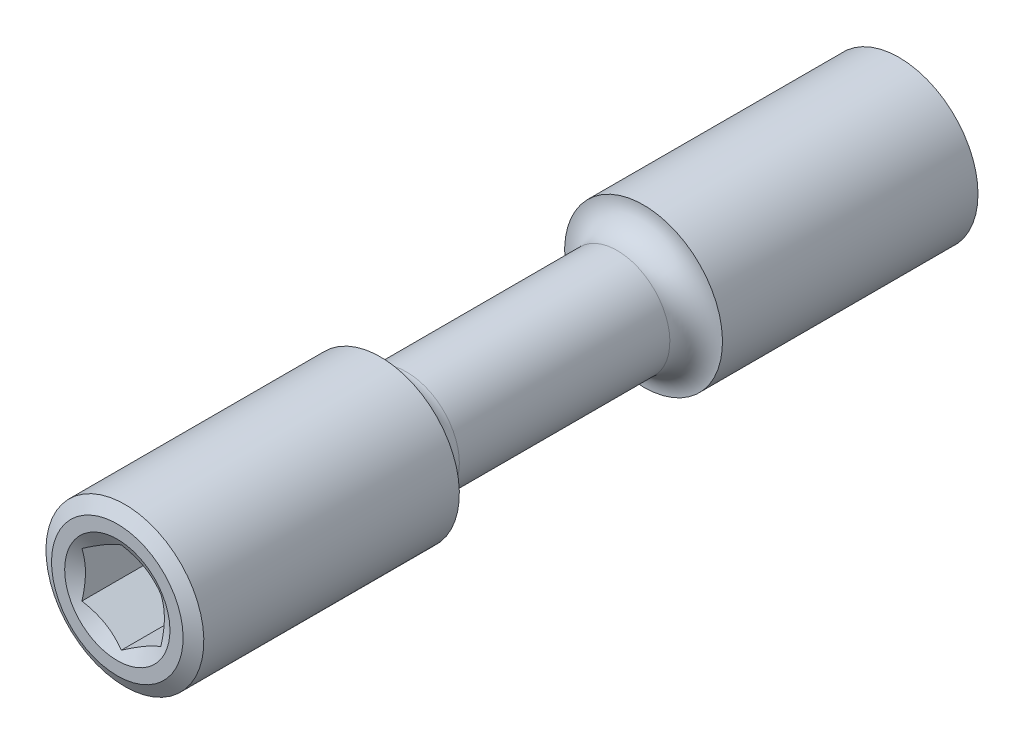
ISO-10303-21;
HEADER;
FILE_DESCRIPTION(('STEP AP214'),'2;1');
FILE_NAME('part.step','',(''),(''),'','','');
FILE_SCHEMA(('AUTOMOTIVE_DESIGN { 1 0 10303 214 1 1 1 1 }'));
ENDSEC;
DATA;
#1=APPLICATION_CONTEXT('core data for automotive mechanical design processes');
#2=APPLICATION_PROTOCOL_DEFINITION('international standard','automotive_design',2000,#1);
#3=PRODUCT_CONTEXT('',#1,'mechanical');
#4=PRODUCT('Part','Part','',(#3));
#5=PRODUCT_RELATED_PRODUCT_CATEGORY('part','',(#4));
#6=PRODUCT_DEFINITION_FORMATION('','',#4);
#7=PRODUCT_DEFINITION_CONTEXT('part definition',#1,'design');
#8=PRODUCT_DEFINITION('design','',#6,#7);
#9=PRODUCT_DEFINITION_SHAPE('','',#8);
#10=(LENGTH_UNIT() NAMED_UNIT(*) SI_UNIT(.MILLI.,.METRE.));
#11=(NAMED_UNIT(*) PLANE_ANGLE_UNIT() SI_UNIT($,.RADIAN.));
#12=(NAMED_UNIT(*) SI_UNIT($,.STERADIAN.) SOLID_ANGLE_UNIT());
#13=UNCERTAINTY_MEASURE_WITH_UNIT(LENGTH_MEASURE(1.E-05),#10,'distance_accuracy_value','');
#14=(GEOMETRIC_REPRESENTATION_CONTEXT(3) GLOBAL_UNCERTAINTY_ASSIGNED_CONTEXT((#13)) GLOBAL_UNIT_ASSIGNED_CONTEXT((#10,
#11,#12)) REPRESENTATION_CONTEXT('',''));
#15=CARTESIAN_POINT('',(0.,0.,0.));
#16=DIRECTION('',(0.,0.,1.));
#17=DIRECTION('',(1.,0.,0.));
#18=AXIS2_PLACEMENT_3D('',#15,#16,#17);
#19=CARTESIAN_POINT('',(0.,0.,15.));
#20=DIRECTION('',(0.,0.,-1.));
#21=DIRECTION('',(0.,-1.,0.));
#22=AXIS2_PLACEMENT_3D('',#19,#20,#21);
#23=PLANE('',#22);
#24=CARTESIAN_POINT('',(0.,0.,15.));
#25=DIRECTION('',(0.,0.,-1.));
#26=DIRECTION('',(0.,-1.,0.));
#27=AXIS2_PLACEMENT_3D('',#24,#25,#26);
#28=CIRCLE('',#27,2.5);
#29=CARTESIAN_POINT('',(0.,-2.50000000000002,15.));
#30=VERTEX_POINT('',#29);
#31=EDGE_CURVE('E255',#30,#30,#28,.F.);
#32=ORIENTED_EDGE('',*,*,#31,.T.);
#33=EDGE_LOOP('',(#32));
#34=FACE_BOUND('',#33,.T.);
#35=CARTESIAN_POINT('',(0.,0.,15.));
#36=DIRECTION('',(0.,0.,-1.));
#37=DIRECTION('',(-1.,0.,0.));
#38=AXIS2_PLACEMENT_3D('',#35,#36,#37);
#39=CIRCLE('',#38,2.);
#40=CARTESIAN_POINT('',(-2.,0.,15.));
#41=VERTEX_POINT('',#40);
#42=EDGE_CURVE('E470',#41,#41,#39,.T.);
#43=ORIENTED_EDGE('',*,*,#42,.T.);
#44=EDGE_LOOP('',(#43));
#45=FACE_BOUND('',#44,.T.);
#46=ADVANCED_FACE('F14',(#34,#45),#23,.F.);
#47=CARTESIAN_POINT('',(0.,0.,15.));
#48=DIRECTION('',(0.,0.,-1.));
#49=DIRECTION('',(0.,-1.,0.));
#50=AXIS2_PLACEMENT_3D('',#47,#48,#49);
#51=CYLINDRICAL_SURFACE('',#50,3.);
#52=CARTESIAN_POINT('',(0.,0.,14.7113248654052));
#53=DIRECTION('',(0.,0.,-1.));
#54=DIRECTION('',(0.,-1.,0.));
#55=AXIS2_PLACEMENT_3D('',#52,#53,#54);
#56=CIRCLE('',#55,3.);
#57=CARTESIAN_POINT('',(0.,-3.00000000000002,14.7113248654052));
#58=VERTEX_POINT('',#57);
#59=EDGE_CURVE('E94',#58,#58,#56,.T.);
#60=ORIENTED_EDGE('',*,*,#59,.T.);
#61=EDGE_LOOP('',(#60));
#62=FACE_BOUND('',#61,.T.);
#63=CARTESIAN_POINT('',(0.,0.,5.));
#64=DIRECTION('',(0.,0.,-1.));
#65=DIRECTION('',(0.,-1.,0.));
#66=AXIS2_PLACEMENT_3D('',#63,#64,#65);
#67=CIRCLE('',#66,3.);
#68=CARTESIAN_POINT('',(0.,-3.00000000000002,5.));
#69=VERTEX_POINT('',#68);
#70=EDGE_CURVE('E127',#69,#69,#67,.T.);
#71=ORIENTED_EDGE('',*,*,#70,.F.);
#72=EDGE_LOOP('',(#71));
#73=FACE_BOUND('',#72,.T.);
#74=ADVANCED_FACE('F211',(#62,#73),#51,.T.);
#75=CARTESIAN_POINT('',(0.,0.,15.));
#76=DIRECTION('',(0.,0.,-1.));
#77=DIRECTION('',(0.,-1.,0.));
#78=AXIS2_PLACEMENT_3D('',#75,#76,#77);
#79=CYLINDRICAL_SURFACE('',#78,2.);
#80=CARTESIAN_POINT('',(0.,0.,4.));
#81=DIRECTION('',(0.,0.,1.));
#82=DIRECTION('',(0.,1.,0.));
#83=AXIS2_PLACEMENT_3D('',#80,#81,#82);
#84=CIRCLE('',#83,2.);
#85=CARTESIAN_POINT('',(0.,1.99999999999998,4.));
#86=VERTEX_POINT('',#85);
#87=EDGE_CURVE('E9',#86,#86,#84,.F.);
#88=ORIENTED_EDGE('',*,*,#87,.T.);
#89=EDGE_LOOP('',(#88));
#90=FACE_BOUND('',#89,.T.);
#91=CARTESIAN_POINT('',(0.,0.,-4.));
#92=DIRECTION('',(0.,0.,-1.));
#93=DIRECTION('',(0.,-1.,0.));
#94=AXIS2_PLACEMENT_3D('',#91,#92,#93);
#95=CIRCLE('',#94,2.);
#96=CARTESIAN_POINT('',(0.,-2.00000000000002,-4.));
#97=VERTEX_POINT('',#96);
#98=EDGE_CURVE('E22',#97,#97,#95,.F.);
#99=ORIENTED_EDGE('',*,*,#98,.T.);
#100=EDGE_LOOP('',(#99));
#101=FACE_BOUND('',#100,.T.);
#102=ADVANCED_FACE('F218',(#90,#101),#79,.T.);
#103=CARTESIAN_POINT('',(0.,0.,15.));
#104=DIRECTION('',(0.,0.,-1.));
#105=DIRECTION('',(0.,-1.,0.));
#106=AXIS2_PLACEMENT_3D('',#103,#104,#105);
#107=CYLINDRICAL_SURFACE('',#106,3.);
#108=CARTESIAN_POINT('',(0.,0.,-14.7113248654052));
#109=DIRECTION('',(0.,0.,1.));
#110=DIRECTION('',(0.,1.,0.));
#111=AXIS2_PLACEMENT_3D('',#108,#109,#110);
#112=CIRCLE('',#111,3.);
#113=CARTESIAN_POINT('',(0.,2.99999999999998,-14.7113248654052));
#114=VERTEX_POINT('',#113);
#115=EDGE_CURVE('E249',#114,#114,#112,.T.);
#116=ORIENTED_EDGE('',*,*,#115,.T.);
#117=EDGE_LOOP('',(#116));
#118=FACE_BOUND('',#117,.T.);
#119=CARTESIAN_POINT('',(0.,0.,-5.));
#120=DIRECTION('',(0.,0.,-1.));
#121=DIRECTION('',(0.,-1.,0.));
#122=AXIS2_PLACEMENT_3D('',#119,#120,#121);
#123=CIRCLE('',#122,3.);
#124=CARTESIAN_POINT('',(0.,-3.00000000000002,-5.));
#125=VERTEX_POINT('',#124);
#126=EDGE_CURVE('E124',#125,#125,#123,.T.);
#127=ORIENTED_EDGE('',*,*,#126,.T.);
#128=EDGE_LOOP('',(#127));
#129=FACE_BOUND('',#128,.T.);
#130=ADVANCED_FACE('F246',(#118,#129),#107,.T.);
#131=CARTESIAN_POINT('',(0.,0.,-15.));
#132=DIRECTION('',(0.,0.,1.));
#133=DIRECTION('',(0.,1.,0.));
#134=AXIS2_PLACEMENT_3D('',#131,#132,#133);
#135=PLANE('',#134);
#136=CARTESIAN_POINT('',(0.,0.,-15.));
#137=DIRECTION('',(0.,0.,1.));
#138=DIRECTION('',(0.,1.,0.));
#139=AXIS2_PLACEMENT_3D('',#136,#137,#138);
#140=CIRCLE('',#139,2.5);
#141=CARTESIAN_POINT('',(0.,2.49999999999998,-15.));
#142=VERTEX_POINT('',#141);
#143=EDGE_CURVE('E251',#142,#142,#140,.F.);
#144=ORIENTED_EDGE('',*,*,#143,.T.);
#145=EDGE_LOOP('',(#144));
#146=FACE_BOUND('',#145,.T.);
#147=ADVANCED_FACE('F146',(#146),#135,.F.);
#148=CARTESIAN_POINT('',(0.,0.,15.));
#149=DIRECTION('',(0.,0.,1.));
#150=DIRECTION('',(1.,0.,0.));
#151=AXIS2_PLACEMENT_3D('',#148,#149,#150);
#152=CONICAL_SURFACE('',#151,2.,1.0471975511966);
#153=ORIENTED_EDGE('',*,*,#42,.F.);
#154=EDGE_LOOP('',(#153));
#155=FACE_BOUND('',#154,.T.);
#156=CARTESIAN_POINT('',(-0.000200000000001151,1.73216627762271,14.8453661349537));
#157=CARTESIAN_POINT('',(0.0657192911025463,1.69410775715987,14.8233823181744));
#158=CARTESIAN_POINT('',(0.132207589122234,1.65572072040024,14.803388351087));
#159=CARTESIAN_POINT('',(0.266335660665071,1.5782818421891,14.7684875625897));
#160=CARTESIAN_POINT('',(0.333977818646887,1.53922862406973,14.7535930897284));
#161=CARTESIAN_POINT('',(0.468423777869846,1.4616062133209,14.7304061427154));
#162=CARTESIAN_POINT('',(0.535206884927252,1.42304896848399,14.721959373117));
#163=CARTESIAN_POINT('',(0.669087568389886,1.34575291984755,14.7118730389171));
#164=CARTESIAN_POINT('',(0.736184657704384,1.30701439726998,14.7102251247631));
#165=CARTESIAN_POINT('',(0.861574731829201,1.23462040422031,14.7136410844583));
#166=CARTESIAN_POINT('',(0.919886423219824,1.20095413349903,14.7178662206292));
#167=CARTESIAN_POINT('',(1.03612987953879,1.13384094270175,14.7312612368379));
#168=CARTESIAN_POINT('',(1.09406124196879,1.10039425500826,14.740435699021));
#169=CARTESIAN_POINT('',(1.21054465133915,1.03314252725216,14.7633726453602));
#170=CARTESIAN_POINT('',(1.26908194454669,0.999346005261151,14.7772324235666));
#171=CARTESIAN_POINT('',(1.38528312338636,0.932257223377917,14.8086892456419));
#172=CARTESIAN_POINT('',(1.44294849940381,0.898964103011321,14.8262788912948));
#173=CARTESIAN_POINT('',(1.5002,0.865909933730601,14.8453661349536));
#174=B_SPLINE_CURVE_WITH_KNOTS('',3,(#156,#157,#158,#159,#160,#161,#162,#163,#164,#165,#166,
#167,#168,#169,#170,#171,#172,#173),.UNSPECIFIED.,.F.,.F.,(4,2,2,2,2,2,2,2,4),(0.,
0.237777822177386,0.476127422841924,0.708577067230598,0.940741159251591,1.14294352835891,
1.34533342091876,1.55221450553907,1.75868901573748),.UNSPECIFIED.);
#175=CARTESIAN_POINT('',(0.,1.73205080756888,14.8452994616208));
#176=VERTEX_POINT('',#175);
#177=CARTESIAN_POINT('',(1.5,0.866025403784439,14.8452994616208));
#178=VERTEX_POINT('',#177);
#179=EDGE_CURVE('E88',#176,#178,#174,.T.);
#180=ORIENTED_EDGE('',*,*,#179,.T.);
#181=CARTESIAN_POINT('',(1.5,-2.27829668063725,15.4201683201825));
#182=CARTESIAN_POINT('',(1.5,-2.21314327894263,15.3887590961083));
#183=CARTESIAN_POINT('',(1.5,-2.14783511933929,15.3576654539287));
#184=CARTESIAN_POINT('',(1.5,-2.01682641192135,15.2962877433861));
#185=CARTESIAN_POINT('',(1.5,-1.95112579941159,15.2660038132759));
#186=CARTESIAN_POINT('',(1.5,-1.81888739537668,15.2062612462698));
#187=CARTESIAN_POINT('',(1.5,-1.75234695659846,15.1768084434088));
#188=CARTESIAN_POINT('',(1.5,-1.61872045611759,15.1191756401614));
#189=CARTESIAN_POINT('',(1.5,-1.55163442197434,15.0909955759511));
#190=CARTESIAN_POINT('',(1.5,-1.4148857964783,15.0354632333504));
#191=CARTESIAN_POINT('',(1.5,-1.34520416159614,15.0081572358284));
#192=CARTESIAN_POINT('',(1.5,-1.20502279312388,14.9557401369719));
#193=CARTESIAN_POINT('',(1.5,-1.13452295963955,14.9306293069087));
#194=CARTESIAN_POINT('',(1.5,-0.921892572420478,14.8596091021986));
#195=CARTESIAN_POINT('',(1.5,-0.778257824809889,14.8178535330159));
#196=CARTESIAN_POINT('',(1.5,-0.560067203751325,14.7689246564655));
#197=CARTESIAN_POINT('',(1.5,-0.487052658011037,14.7549158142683));
#198=CARTESIAN_POINT('',(1.5,-0.340164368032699,14.7323734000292));
#199=CARTESIAN_POINT('',(1.5,-0.266290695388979,14.7238393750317));
#200=CARTESIAN_POINT('',(1.5,-0.118999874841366,14.7130363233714));
#201=CARTESIAN_POINT('',(1.5,-0.0455885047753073,14.7106905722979));
#202=CARTESIAN_POINT('',(1.5,0.101165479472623,14.7122563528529));
#203=CARTESIAN_POINT('',(1.5,0.174508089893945,14.71616820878));
#204=CARTESIAN_POINT('',(1.5,0.353360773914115,14.7329926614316));
#205=CARTESIAN_POINT('',(1.5,0.458566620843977,14.7491516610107));
#206=CARTESIAN_POINT('',(1.5,0.666968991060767,14.7913869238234));
#207=CARTESIAN_POINT('',(1.5,0.770163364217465,14.8174732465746));
#208=CARTESIAN_POINT('',(1.5,0.976776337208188,14.8774371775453));
#209=CARTESIAN_POINT('',(1.5,1.08014595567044,14.9114795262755));
#210=CARTESIAN_POINT('',(1.5,1.23376876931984,14.9663975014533));
#211=CARTESIAN_POINT('',(1.5,1.28473152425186,14.9853433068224));
#212=CARTESIAN_POINT('',(1.5,1.38624265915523,15.0243145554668));
#213=CARTESIAN_POINT('',(1.5,1.43679104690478,15.0443399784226));
#214=CARTESIAN_POINT('',(1.5,1.56913564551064,15.0981347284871));
#215=CARTESIAN_POINT('',(1.5,1.65063135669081,15.132641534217));
#216=CARTESIAN_POINT('',(1.5,1.81284754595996,15.2034369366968));
#217=CARTESIAN_POINT('',(1.5,1.89356795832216,15.239725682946));
#218=CARTESIAN_POINT('',(1.5,2.13484537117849,15.3506237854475));
#219=CARTESIAN_POINT('',(1.5,2.29447472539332,15.4272466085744));
#220=CARTESIAN_POINT('',(1.5,2.61233200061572,15.5838318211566));
#221=CARTESIAN_POINT('',(1.5,2.77055775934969,15.6637985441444));
#222=CARTESIAN_POINT('',(1.5,3.08589273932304,15.8258358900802));
#223=CARTESIAN_POINT('',(1.5,3.24300214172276,15.9079061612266));
#224=CARTESIAN_POINT('',(1.5,3.54089305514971,16.0652617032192));
#225=CARTESIAN_POINT('',(1.5,3.68174649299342,16.1404113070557));
#226=CARTESIAN_POINT('',(1.5,3.96299957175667,16.2915707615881));
#227=CARTESIAN_POINT('',(1.5,4.10339918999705,16.3675806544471));
#228=CARTESIAN_POINT('',(1.5,4.38345606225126,16.5200274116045));
#229=CARTESIAN_POINT('',(1.5,4.52311429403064,16.5964624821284));
#230=CARTESIAN_POINT('',(1.5,4.80214740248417,16.7498269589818));
#231=CARTESIAN_POINT('',(1.5,4.94152229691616,16.82675633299));
#232=CARTESIAN_POINT('',(1.5,5.08079657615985,16.9038663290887));
#233=B_SPLINE_CURVE_WITH_KNOTS('',3,(#181,#182,#183,#184,#185,#186,#187,#188,#189,#190,#191,
#192,#193,#194,#195,#196,#197,#198,#199,#200,#201,#202,#203,#204,#205,#206,#207,#208,#209,#210,
#211,#212,#213,#214,#215,#216,#217,#218,#219,#220,#221,#222,#223,#224,#225,#226,#227,#228,#229,
#230,#231,#232),.UNSPECIFIED.,.F.,.F.,(4,2,2,2,2,2,2,2,2,2,2,2,2,2,2,2,2,2,2,2,2,2,2,2,2,4),(0.,
0.216990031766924,0.434016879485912,0.65230775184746,0.8705876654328,1.09507057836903,
1.31958119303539,1.76738754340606,1.9902617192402,2.21311745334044,2.43319686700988,
2.6532876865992,2.97194700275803,3.29093008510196,3.61721788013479,3.78032122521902,
3.94342150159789,4.20889133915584,4.47438348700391,5.00551027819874,5.53734811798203,
6.06909758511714,6.54803514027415,7.02699627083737,7.50461499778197,7.98220280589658),.UNSPECIFIED.);
#234=CARTESIAN_POINT('',(1.5,-0.86602540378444,14.8452994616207));
#235=VERTEX_POINT('',#234);
#236=EDGE_CURVE('E108',#178,#235,#233,.F.);
#237=ORIENTED_EDGE('',*,*,#236,.T.);
#238=CARTESIAN_POINT('',(1.5002,-0.865909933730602,14.8453661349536));
#239=CARTESIAN_POINT('',(1.43428070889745,-0.903968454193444,14.8233823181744));
#240=CARTESIAN_POINT('',(1.36779241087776,-0.942355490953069,14.803388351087));
#241=CARTESIAN_POINT('',(1.23366433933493,-1.01979436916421,14.7684875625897));
#242=CARTESIAN_POINT('',(1.16602218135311,-1.05884758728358,14.7535930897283));
#243=CARTESIAN_POINT('',(1.03157622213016,-1.13646999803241,14.7304061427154));
#244=CARTESIAN_POINT('',(0.964793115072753,-1.17502724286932,14.721959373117));
#245=CARTESIAN_POINT('',(0.830912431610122,-1.25232329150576,14.711873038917));
#246=CARTESIAN_POINT('',(0.763815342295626,-1.29106181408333,14.7102251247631));
#247=CARTESIAN_POINT('',(0.638425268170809,-1.363455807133,14.7136410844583));
#248=CARTESIAN_POINT('',(0.580113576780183,-1.39712207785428,14.7178662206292));
#249=CARTESIAN_POINT('',(0.463870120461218,-1.46423526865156,14.7312612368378));
#250=CARTESIAN_POINT('',(0.405938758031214,-1.49768195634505,14.740435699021));
#251=CARTESIAN_POINT('',(0.289455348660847,-1.56493368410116,14.7633726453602));
#252=CARTESIAN_POINT('',(0.230918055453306,-1.59873020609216,14.7772324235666));
#253=CARTESIAN_POINT('',(0.114716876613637,-1.6658189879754,14.8086892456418));
#254=CARTESIAN_POINT('',(0.0570515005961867,-1.69911210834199,14.8262788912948));
#255=CARTESIAN_POINT('',(-0.000200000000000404,-1.73216627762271,14.8453661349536));
#256=B_SPLINE_CURVE_WITH_KNOTS('',3,(#238,#239,#240,#241,#242,#243,#244,#245,#246,#247,#248,
#249,#250,#251,#252,#253,#254,#255),.UNSPECIFIED.,.F.,.F.,(4,2,2,2,2,2,2,2,4),(0.,
0.237777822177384,0.476127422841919,0.708577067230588,0.940741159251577,1.1429435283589,
1.34533342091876,1.55221450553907,1.75868901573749),.UNSPECIFIED.);
#257=CARTESIAN_POINT('',(0.,-1.73205080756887,14.8452994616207));
#258=VERTEX_POINT('',#257);
#259=EDGE_CURVE('E169',#235,#258,#256,.T.);
#260=ORIENTED_EDGE('',*,*,#259,.T.);
#261=CARTESIAN_POINT('',(0.000199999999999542,-1.73216627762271,14.8453661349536));
#262=CARTESIAN_POINT('',(-0.0657192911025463,-1.69410775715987,14.8233823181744));
#263=CARTESIAN_POINT('',(-0.132207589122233,-1.65572072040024,14.803388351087));
#264=CARTESIAN_POINT('',(-0.266335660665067,-1.5782818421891,14.7684875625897));
#265=CARTESIAN_POINT('',(-0.333977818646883,-1.53922862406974,14.7535930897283));
#266=CARTESIAN_POINT('',(-0.468423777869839,-1.4616062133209,14.7304061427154));
#267=CARTESIAN_POINT('',(-0.535206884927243,-1.42304896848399,14.721959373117));
#268=CARTESIAN_POINT('',(-0.669087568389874,-1.34575291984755,14.711873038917));
#269=CARTESIAN_POINT('',(-0.736184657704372,-1.30701439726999,14.7102251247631));
#270=CARTESIAN_POINT('',(-0.861574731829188,-1.23462040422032,14.7136410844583));
#271=CARTESIAN_POINT('',(-0.919886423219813,-1.20095413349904,14.7178662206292));
#272=CARTESIAN_POINT('',(-1.03612987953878,-1.13384094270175,14.7312612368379));
#273=CARTESIAN_POINT('',(-1.09406124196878,-1.10039425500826,14.740435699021));
#274=CARTESIAN_POINT('',(-1.21054465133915,-1.03314252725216,14.7633726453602));
#275=CARTESIAN_POINT('',(-1.26908194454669,-0.999346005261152,14.7772324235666));
#276=CARTESIAN_POINT('',(-1.38528312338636,-0.932257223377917,14.8086892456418));
#277=CARTESIAN_POINT('',(-1.44294849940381,-0.898964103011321,14.8262788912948));
#278=CARTESIAN_POINT('',(-1.5002,-0.865909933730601,14.8453661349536));
#279=B_SPLINE_CURVE_WITH_KNOTS('',3,(#261,#262,#263,#264,#265,#266,#267,#268,#269,#270,#271,
#272,#273,#274,#275,#276,#277,#278),.UNSPECIFIED.,.F.,.F.,(4,2,2,2,2,2,2,2,4),(0.,
0.237777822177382,0.476127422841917,0.708577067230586,0.940741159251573,1.1429435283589,
1.34533342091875,1.55221450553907,1.75868901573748),.UNSPECIFIED.);
#280=CARTESIAN_POINT('',(-1.5,-0.866025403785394,14.8452994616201));
#281=VERTEX_POINT('',#280);
#282=EDGE_CURVE('E162',#258,#281,#279,.T.);
#283=ORIENTED_EDGE('',*,*,#282,.T.);
#284=CARTESIAN_POINT('',(-1.5,-2.27829668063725,15.4201683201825));
#285=CARTESIAN_POINT('',(-1.5,-2.21314327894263,15.3887590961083));
#286=CARTESIAN_POINT('',(-1.5,-2.14783511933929,15.3576654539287));
#287=CARTESIAN_POINT('',(-1.5,-2.01682641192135,15.2962877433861));
#288=CARTESIAN_POINT('',(-1.5,-1.95112579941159,15.2660038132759));
#289=CARTESIAN_POINT('',(-1.5,-1.81888739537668,15.2062612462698));
#290=CARTESIAN_POINT('',(-1.5,-1.75234695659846,15.1768084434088));
#291=CARTESIAN_POINT('',(-1.5,-1.61872045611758,15.1191756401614));
#292=CARTESIAN_POINT('',(-1.5,-1.55163442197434,15.0909955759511));
#293=CARTESIAN_POINT('',(-1.5,-1.4148857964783,15.0354632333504));
#294=CARTESIAN_POINT('',(-1.5,-1.34520416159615,15.0081572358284));
#295=CARTESIAN_POINT('',(-1.5,-1.20502279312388,14.9557401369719));
#296=CARTESIAN_POINT('',(-1.5,-1.13452295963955,14.9306293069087));
#297=CARTESIAN_POINT('',(-1.5,-0.921892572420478,14.8596091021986));
#298=CARTESIAN_POINT('',(-1.5,-0.778257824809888,14.8178535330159));
#299=CARTESIAN_POINT('',(-1.5,-0.560067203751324,14.7689246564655));
#300=CARTESIAN_POINT('',(-1.5,-0.487052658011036,14.7549158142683));
#301=CARTESIAN_POINT('',(-1.5,-0.340164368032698,14.7323734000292));
#302=CARTESIAN_POINT('',(-1.5,-0.266290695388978,14.7238393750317));
#303=CARTESIAN_POINT('',(-1.5,-0.118999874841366,14.7130363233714));
#304=CARTESIAN_POINT('',(-1.5,-0.0455885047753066,14.7106905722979));
#305=CARTESIAN_POINT('',(-1.5,0.101165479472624,14.7122563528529));
#306=CARTESIAN_POINT('',(-1.5,0.174508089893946,14.71616820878));
#307=CARTESIAN_POINT('',(-1.5,0.353360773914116,14.7329926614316));
#308=CARTESIAN_POINT('',(-1.5,0.458566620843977,14.7491516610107));
#309=CARTESIAN_POINT('',(-1.5,0.666968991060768,14.7913869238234));
#310=CARTESIAN_POINT('',(-1.5,0.770163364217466,14.8174732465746));
#311=CARTESIAN_POINT('',(-1.5,0.976776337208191,14.8774371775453));
#312=CARTESIAN_POINT('',(-1.5,1.08014595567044,14.9114795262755));
#313=CARTESIAN_POINT('',(-1.5,1.23376876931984,14.9663975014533));
#314=CARTESIAN_POINT('',(-1.5,1.28473152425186,14.9853433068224));
#315=CARTESIAN_POINT('',(-1.5,1.38624265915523,15.0243145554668));
#316=CARTESIAN_POINT('',(-1.5,1.43679104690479,15.0443399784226));
#317=CARTESIAN_POINT('',(-1.5,1.56913564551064,15.0981347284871));
#318=CARTESIAN_POINT('',(-1.5,1.65063135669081,15.132641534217));
#319=CARTESIAN_POINT('',(-1.5,1.81284754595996,15.2034369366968));
#320=CARTESIAN_POINT('',(-1.5,1.89356795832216,15.239725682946));
#321=CARTESIAN_POINT('',(-1.5,2.13484537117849,15.3506237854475));
#322=CARTESIAN_POINT('',(-1.5,2.29447472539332,15.4272466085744));
#323=CARTESIAN_POINT('',(-1.5,2.61233200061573,15.5838318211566));
#324=CARTESIAN_POINT('',(-1.5,2.7705577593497,15.6637985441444));
#325=CARTESIAN_POINT('',(-1.5,3.08589273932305,15.8258358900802));
#326=CARTESIAN_POINT('',(-1.5,3.24300214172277,15.9079061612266));
#327=CARTESIAN_POINT('',(-1.5,3.54089305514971,16.0652617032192));
#328=CARTESIAN_POINT('',(-1.5,3.68174649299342,16.1404113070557));
#329=CARTESIAN_POINT('',(-1.5,3.96299957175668,16.2915707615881));
#330=CARTESIAN_POINT('',(-1.5,4.10339918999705,16.3675806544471));
#331=CARTESIAN_POINT('',(-1.5,4.38345606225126,16.5200274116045));
#332=CARTESIAN_POINT('',(-1.5,4.52311429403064,16.5964624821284));
#333=CARTESIAN_POINT('',(-1.5,4.80214740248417,16.7498269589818));
#334=CARTESIAN_POINT('',(-1.5,4.94152229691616,16.82675633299));
#335=CARTESIAN_POINT('',(-1.5,5.08079657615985,16.9038663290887));
#336=B_SPLINE_CURVE_WITH_KNOTS('',3,(#284,#285,#286,#287,#288,#289,#290,#291,#292,#293,#294,
#295,#296,#297,#298,#299,#300,#301,#302,#303,#304,#305,#306,#307,#308,#309,#310,#311,#312,#313,
#314,#315,#316,#317,#318,#319,#320,#321,#322,#323,#324,#325,#326,#327,#328,#329,#330,#331,#332,
#333,#334,#335),.UNSPECIFIED.,.F.,.F.,(4,2,2,2,2,2,2,2,2,2,2,2,2,2,2,2,2,2,2,2,2,2,2,2,2,4),(0.,
0.216990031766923,0.434016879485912,0.65230775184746,0.870587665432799,1.09507057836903,
1.31958119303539,1.76738754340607,1.9902617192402,2.21311745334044,2.43319686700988,
2.6532876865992,2.97194700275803,3.29093008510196,3.61721788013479,3.78032122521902,
3.94342150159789,4.20889133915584,4.47438348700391,5.00551027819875,5.53734811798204,
6.06909758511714,6.54803514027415,7.02699627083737,7.50461499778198,7.98220280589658),.UNSPECIFIED.);
#337=CARTESIAN_POINT('',(-1.5,0.866025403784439,14.8452994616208));
#338=VERTEX_POINT('',#337);
#339=EDGE_CURVE('E29',#281,#338,#336,.T.);
#340=ORIENTED_EDGE('',*,*,#339,.T.);
#341=CARTESIAN_POINT('',(-1.5002,0.865909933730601,14.8453661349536));
#342=CARTESIAN_POINT('',(-1.43428070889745,0.903968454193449,14.8233823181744));
#343=CARTESIAN_POINT('',(-1.36779241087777,0.942355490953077,14.803388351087));
#344=CARTESIAN_POINT('',(-1.23366433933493,1.01979436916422,14.7684875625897));
#345=CARTESIAN_POINT('',(-1.16602218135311,1.05884758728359,14.7535930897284));
#346=CARTESIAN_POINT('',(-1.03157622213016,1.13646999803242,14.7304061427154));
#347=CARTESIAN_POINT('',(-0.964793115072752,1.17502724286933,14.721959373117));
#348=CARTESIAN_POINT('',(-0.830912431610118,1.25232329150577,14.7118730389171));
#349=CARTESIAN_POINT('',(-0.763815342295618,1.29106181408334,14.7102251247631));
#350=CARTESIAN_POINT('',(-0.638425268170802,1.36345580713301,14.7136410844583));
#351=CARTESIAN_POINT('',(-0.58011357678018,1.39712207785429,14.7178662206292));
#352=CARTESIAN_POINT('',(-0.463870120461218,1.46423526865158,14.7312612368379));
#353=CARTESIAN_POINT('',(-0.405938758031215,1.49768195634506,14.7404356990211));
#354=CARTESIAN_POINT('',(-0.289455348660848,1.56493368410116,14.7633726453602));
#355=CARTESIAN_POINT('',(-0.230918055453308,1.59873020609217,14.7772324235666));
#356=CARTESIAN_POINT('',(-0.114716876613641,1.6658189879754,14.8086892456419));
#357=CARTESIAN_POINT('',(-0.0570515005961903,1.699112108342,14.8262788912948));
#358=CARTESIAN_POINT('',(0.000199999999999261,1.73216627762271,14.8453661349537));
#359=B_SPLINE_CURVE_WITH_KNOTS('',3,(#341,#342,#343,#344,#345,#346,#347,#348,#349,#350,#351,
#352,#353,#354,#355,#356,#357,#358),.UNSPECIFIED.,.F.,.F.,(4,2,2,2,2,2,2,2,4),(0.,
0.237777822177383,0.47612742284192,0.708577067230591,0.940741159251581,1.1429435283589,
1.34533342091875,1.55221450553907,1.75868901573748),.UNSPECIFIED.);
#360=EDGE_CURVE('E85',#338,#176,#359,.T.);
#361=ORIENTED_EDGE('',*,*,#360,.T.);
#362=EDGE_LOOP('',(#180,#237,#260,#283,#340,#361));
#363=FACE_BOUND('',#362,.T.);
#364=ADVANCED_FACE('F87',(#155,#363),#152,.F.);
#365=CARTESIAN_POINT('',(0.,0.,10.));
#366=DIRECTION('',(0.,0.,1.));
#367=DIRECTION('',(1.,0.,0.));
#368=AXIS2_PLACEMENT_3D('',#365,#366,#367);
#369=CONICAL_SURFACE('',#368,1.5,1.02974425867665);
#370=CARTESIAN_POINT('',(0.,0.,9.09870907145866));
#371=VERTEX_POINT('',#370);
#372=VERTEX_LOOP('',#371);
#373=FACE_BOUND('',#372,.T.);
#374=CARTESIAN_POINT('',(0.,0.,10.));
#375=DIRECTION('',(0.,0.,1.));
#376=DIRECTION('',(1.,0.,0.));
#377=AXIS2_PLACEMENT_3D('',#374,#375,#376);
#378=CIRCLE('',#377,1.5);
#379=CARTESIAN_POINT('',(1.5,0.,10.));
#380=VERTEX_POINT('',#379);
#381=EDGE_CURVE('E107',#380,#380,#378,.T.);
#382=ORIENTED_EDGE('',*,*,#381,.T.);
#383=EDGE_LOOP('',(#382));
#384=FACE_BOUND('',#383,.T.);
#385=ADVANCED_FACE('F145',(#373,#384),#369,.F.);
#386=CARTESIAN_POINT('',(0.,0.,15.));
#387=DIRECTION('',(0.,0.,1.));
#388=DIRECTION('',(1.,0.,0.));
#389=AXIS2_PLACEMENT_3D('',#386,#387,#388);
#390=CYLINDRICAL_SURFACE('',#389,1.5);
#391=CARTESIAN_POINT('',(0.,0.,11.5));
#392=DIRECTION('',(0.,0.,1.));
#393=DIRECTION('',(1.,0.,0.));
#394=AXIS2_PLACEMENT_3D('',#391,#392,#393);
#395=CIRCLE('',#394,1.5);
#396=CARTESIAN_POINT('',(1.5,0.,11.5));
#397=VERTEX_POINT('',#396);
#398=CARTESIAN_POINT('',(0.75,1.29903810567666,11.5));
#399=VERTEX_POINT('',#398);
#400=EDGE_CURVE('E95',#397,#399,#395,.T.);
#401=ORIENTED_EDGE('',*,*,#400,.T.);
#402=CARTESIAN_POINT('',(-0.75,1.29903810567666,11.5));
#403=VERTEX_POINT('',#402);
#404=EDGE_CURVE('E439',#399,#403,#395,.T.);
#405=ORIENTED_EDGE('',*,*,#404,.T.);
#406=CARTESIAN_POINT('',(-1.5,0.,11.5));
#407=VERTEX_POINT('',#406);
#408=EDGE_CURVE('E434',#403,#407,#395,.T.);
#409=ORIENTED_EDGE('',*,*,#408,.T.);
#410=CARTESIAN_POINT('',(-0.75,-1.29903810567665,11.5));
#411=VERTEX_POINT('',#410);
#412=EDGE_CURVE('E440',#407,#411,#395,.T.);
#413=ORIENTED_EDGE('',*,*,#412,.T.);
#414=CARTESIAN_POINT('',(0.75,-1.29903810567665,11.5));
#415=VERTEX_POINT('',#414);
#416=EDGE_CURVE('E37',#411,#415,#395,.T.);
#417=ORIENTED_EDGE('',*,*,#416,.T.);
#418=EDGE_CURVE('E130',#415,#397,#395,.T.);
#419=ORIENTED_EDGE('',*,*,#418,.T.);
#420=EDGE_LOOP('',(#401,#405,#409,#413,#417,#419));
#421=FACE_BOUND('',#420,.T.);
#422=ORIENTED_EDGE('',*,*,#381,.F.);
#423=EDGE_LOOP('',(#422));
#424=FACE_BOUND('',#423,.T.);
#425=ADVANCED_FACE('F148',(#421,#424),#390,.F.);
#426=CARTESIAN_POINT('',(0.,1.73205080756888,11.5));
#427=DIRECTION('',(0.,0.,1.));
#428=DIRECTION('',(1.,0.,0.));
#429=AXIS2_PLACEMENT_3D('',#426,#427,#428);
#430=PLANE('',#429);
#431=ORIENTED_EDGE('',*,*,#400,.F.);
#432=DIRECTION('',(0.,1.,0.));
#433=VECTOR('',#432,1.);
#434=CARTESIAN_POINT('',(1.5,-0.866025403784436,11.5));
#435=LINE('',#434,#433);
#436=CARTESIAN_POINT('',(1.5,0.866025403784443,11.5));
#437=VERTEX_POINT('',#436);
#438=EDGE_CURVE('E120',#397,#437,#435,.T.);
#439=ORIENTED_EDGE('',*,*,#438,.T.);
#440=DIRECTION('',(-0.866025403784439,0.5,0.));
#441=VECTOR('',#440,1.);
#442=CARTESIAN_POINT('',(1.5,0.866025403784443,11.5));
#443=LINE('',#442,#441);
#444=EDGE_CURVE('E441',#437,#399,#443,.T.);
#445=ORIENTED_EDGE('',*,*,#444,.T.);
#446=EDGE_LOOP('',(#431,#439,#445));
#447=FACE_BOUND('',#446,.T.);
#448=ADVANCED_FACE('F341',(#447),#430,.T.);
#449=ORIENTED_EDGE('',*,*,#418,.F.);
#450=DIRECTION('',(0.866025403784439,0.5,0.));
#451=VECTOR('',#450,1.);
#452=CARTESIAN_POINT('',(0.,-1.73205080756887,11.5));
#453=LINE('',#452,#451);
#454=CARTESIAN_POINT('',(1.5,-0.866025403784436,11.5));
#455=VERTEX_POINT('',#454);
#456=EDGE_CURVE('E453',#415,#455,#453,.T.);
#457=ORIENTED_EDGE('',*,*,#456,.T.);
#458=EDGE_CURVE('E115',#455,#397,#435,.T.);
#459=ORIENTED_EDGE('',*,*,#458,.T.);
#460=EDGE_LOOP('',(#449,#457,#459));
#461=FACE_BOUND('',#460,.T.);
#462=ADVANCED_FACE('F192',(#461),#430,.T.);
#463=ORIENTED_EDGE('',*,*,#416,.F.);
#464=DIRECTION('',(0.866025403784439,-0.5,0.));
#465=VECTOR('',#464,1.);
#466=CARTESIAN_POINT('',(-1.5,-0.866025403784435,11.5));
#467=LINE('',#466,#465);
#468=CARTESIAN_POINT('',(0.,-1.73205080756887,11.5));
#469=VERTEX_POINT('',#468);
#470=EDGE_CURVE('E449',#411,#469,#467,.T.);
#471=ORIENTED_EDGE('',*,*,#470,.T.);
#472=EDGE_CURVE('E454',#469,#415,#453,.T.);
#473=ORIENTED_EDGE('',*,*,#472,.T.);
#474=EDGE_LOOP('',(#463,#471,#473));
#475=FACE_BOUND('',#474,.T.);
#476=ADVANCED_FACE('F354',(#475),#430,.T.);
#477=ORIENTED_EDGE('',*,*,#412,.F.);
#478=DIRECTION('',(0.,-1.,0.));
#479=VECTOR('',#478,1.);
#480=CARTESIAN_POINT('',(-1.5,0.866025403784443,11.5));
#481=LINE('',#480,#479);
#482=CARTESIAN_POINT('',(-1.5,-0.866025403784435,11.5));
#483=VERTEX_POINT('',#482);
#484=EDGE_CURVE('E445',#407,#483,#481,.T.);
#485=ORIENTED_EDGE('',*,*,#484,.T.);
#486=EDGE_CURVE('E450',#483,#411,#467,.T.);
#487=ORIENTED_EDGE('',*,*,#486,.T.);
#488=EDGE_LOOP('',(#477,#485,#487));
#489=FACE_BOUND('',#488,.T.);
#490=ADVANCED_FACE('F361',(#489),#430,.T.);
#491=ORIENTED_EDGE('',*,*,#404,.F.);
#492=CARTESIAN_POINT('',(0.,1.73205080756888,11.5));
#493=VERTEX_POINT('',#492);
#494=EDGE_CURVE('E444',#399,#493,#443,.T.);
#495=ORIENTED_EDGE('',*,*,#494,.T.);
#496=DIRECTION('',(-0.866025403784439,-0.5,0.));
#497=VECTOR('',#496,1.);
#498=CARTESIAN_POINT('',(0.,1.73205080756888,11.5));
#499=LINE('',#498,#497);
#500=EDGE_CURVE('E113',#493,#403,#499,.T.);
#501=ORIENTED_EDGE('',*,*,#500,.T.);
#502=EDGE_LOOP('',(#491,#495,#501));
#503=FACE_BOUND('',#502,.T.);
#504=ADVANCED_FACE('F348',(#503),#430,.T.);
#505=ORIENTED_EDGE('',*,*,#408,.F.);
#506=CARTESIAN_POINT('',(-1.5,0.866025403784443,11.5));
#507=VERTEX_POINT('',#506);
#508=EDGE_CURVE('E435',#403,#507,#499,.T.);
#509=ORIENTED_EDGE('',*,*,#508,.T.);
#510=EDGE_CURVE('E437',#507,#407,#481,.T.);
#511=ORIENTED_EDGE('',*,*,#510,.T.);
#512=EDGE_LOOP('',(#505,#509,#511));
#513=FACE_BOUND('',#512,.T.);
#514=ADVANCED_FACE('F209',(#513),#430,.T.);
#515=CARTESIAN_POINT('',(0.,1.73205080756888,11.5));
#516=DIRECTION('',(-0.5,0.866025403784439,0.));
#517=DIRECTION('',(-0.866025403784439,-0.5,0.));
#518=AXIS2_PLACEMENT_3D('',#515,#516,#517);
#519=PLANE('',#518);
#520=ORIENTED_EDGE('',*,*,#360,.F.);
#521=DIRECTION('',(0.,0.,1.));
#522=VECTOR('',#521,1.);
#523=CARTESIAN_POINT('',(-1.5,0.866025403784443,11.5));
#524=LINE('',#523,#522);
#525=EDGE_CURVE('E114',#507,#338,#524,.T.);
#526=ORIENTED_EDGE('',*,*,#525,.F.);
#527=ORIENTED_EDGE('',*,*,#508,.F.);
#528=ORIENTED_EDGE('',*,*,#500,.F.);
#529=DIRECTION('',(0.,0.,1.));
#530=VECTOR('',#529,1.);
#531=CARTESIAN_POINT('',(0.,1.73205080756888,11.5));
#532=LINE('',#531,#530);
#533=EDGE_CURVE('E102',#493,#176,#532,.T.);
#534=ORIENTED_EDGE('',*,*,#533,.T.);
#535=EDGE_LOOP('',(#520,#526,#527,#528,#534));
#536=FACE_BOUND('',#535,.T.);
#537=ADVANCED_FACE('F110',(#536),#519,.F.);
#538=CARTESIAN_POINT('',(-1.5,0.866025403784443,11.5));
#539=DIRECTION('',(-1.,0.,0.));
#540=DIRECTION('',(0.,0.,1.));
#541=AXIS2_PLACEMENT_3D('',#538,#539,#540);
#542=PLANE('',#541);
#543=ORIENTED_EDGE('',*,*,#339,.F.);
#544=DIRECTION('',(0.,0.,1.));
#545=VECTOR('',#544,1.);
#546=CARTESIAN_POINT('',(-1.5,-0.866025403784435,11.5));
#547=LINE('',#546,#545);
#548=EDGE_CURVE('E117',#483,#281,#547,.T.);
#549=ORIENTED_EDGE('',*,*,#548,.F.);
#550=ORIENTED_EDGE('',*,*,#484,.F.);
#551=ORIENTED_EDGE('',*,*,#510,.F.);
#552=ORIENTED_EDGE('',*,*,#525,.T.);
#553=EDGE_LOOP('',(#543,#549,#550,#551,#552));
#554=FACE_BOUND('',#553,.T.);
#555=ADVANCED_FACE('F199',(#554),#542,.F.);
#556=CARTESIAN_POINT('',(-1.5,-0.866025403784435,11.5));
#557=DIRECTION('',(-0.5,-0.866025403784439,0.));
#558=DIRECTION('',(0.866025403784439,-0.5,0.));
#559=AXIS2_PLACEMENT_3D('',#556,#557,#558);
#560=PLANE('',#559);
#561=ORIENTED_EDGE('',*,*,#282,.F.);
#562=DIRECTION('',(0.,0.,1.));
#563=VECTOR('',#562,1.);
#564=CARTESIAN_POINT('',(0.,-1.73205080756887,11.5));
#565=LINE('',#564,#563);
#566=EDGE_CURVE('E461',#469,#258,#565,.T.);
#567=ORIENTED_EDGE('',*,*,#566,.F.);
#568=ORIENTED_EDGE('',*,*,#470,.F.);
#569=ORIENTED_EDGE('',*,*,#486,.F.);
#570=ORIENTED_EDGE('',*,*,#548,.T.);
#571=EDGE_LOOP('',(#561,#567,#568,#569,#570));
#572=FACE_BOUND('',#571,.T.);
#573=ADVANCED_FACE('F195',(#572),#560,.F.);
#574=CARTESIAN_POINT('',(0.,-1.73205080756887,11.5));
#575=DIRECTION('',(0.5,-0.866025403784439,0.));
#576=DIRECTION('',(0.866025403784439,0.5,0.));
#577=AXIS2_PLACEMENT_3D('',#574,#575,#576);
#578=PLANE('',#577);
#579=ORIENTED_EDGE('',*,*,#259,.F.);
#580=DIRECTION('',(0.,0.,1.));
#581=VECTOR('',#580,1.);
#582=CARTESIAN_POINT('',(1.5,-0.866025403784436,11.5));
#583=LINE('',#582,#581);
#584=EDGE_CURVE('E458',#455,#235,#583,.T.);
#585=ORIENTED_EDGE('',*,*,#584,.F.);
#586=ORIENTED_EDGE('',*,*,#456,.F.);
#587=ORIENTED_EDGE('',*,*,#472,.F.);
#588=ORIENTED_EDGE('',*,*,#566,.T.);
#589=EDGE_LOOP('',(#579,#585,#586,#587,#588));
#590=FACE_BOUND('',#589,.T.);
#591=ADVANCED_FACE('F190',(#590),#578,.F.);
#592=CARTESIAN_POINT('',(1.5,-0.866025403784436,11.5));
#593=DIRECTION('',(1.,0.,0.));
#594=DIRECTION('',(0.,0.,-1.));
#595=AXIS2_PLACEMENT_3D('',#592,#593,#594);
#596=PLANE('',#595);
#597=ORIENTED_EDGE('',*,*,#236,.F.);
#598=DIRECTION('',(0.,0.,1.));
#599=VECTOR('',#598,1.);
#600=CARTESIAN_POINT('',(1.5,0.866025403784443,11.5));
#601=LINE('',#600,#599);
#602=EDGE_CURVE('E106',#437,#178,#601,.T.);
#603=ORIENTED_EDGE('',*,*,#602,.F.);
#604=ORIENTED_EDGE('',*,*,#438,.F.);
#605=ORIENTED_EDGE('',*,*,#458,.F.);
#606=ORIENTED_EDGE('',*,*,#584,.T.);
#607=EDGE_LOOP('',(#597,#603,#604,#605,#606));
#608=FACE_BOUND('',#607,.T.);
#609=ADVANCED_FACE('F186',(#608),#596,.F.);
#610=CARTESIAN_POINT('',(1.5,0.866025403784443,11.5));
#611=DIRECTION('',(0.5,0.866025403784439,0.));
#612=DIRECTION('',(-0.866025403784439,0.5,0.));
#613=AXIS2_PLACEMENT_3D('',#610,#611,#612);
#614=PLANE('',#613);
#615=ORIENTED_EDGE('',*,*,#179,.F.);
#616=ORIENTED_EDGE('',*,*,#533,.F.);
#617=ORIENTED_EDGE('',*,*,#494,.F.);
#618=ORIENTED_EDGE('',*,*,#444,.F.);
#619=ORIENTED_EDGE('',*,*,#602,.T.);
#620=EDGE_LOOP('',(#615,#616,#617,#618,#619));
#621=FACE_BOUND('',#620,.T.);
#622=ADVANCED_FACE('F100',(#621),#614,.F.);
#623=CARTESIAN_POINT('',(0.,0.,14.7113248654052));
#624=DIRECTION('',(0.,0.,-1.));
#625=DIRECTION('',(0.,-1.,0.));
#626=AXIS2_PLACEMENT_3D('',#623,#624,#625);
#627=CONICAL_SURFACE('',#626,3.,1.0471975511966);
#628=ORIENTED_EDGE('',*,*,#31,.F.);
#629=EDGE_LOOP('',(#628));
#630=FACE_BOUND('',#629,.T.);
#631=ORIENTED_EDGE('',*,*,#59,.F.);
#632=EDGE_LOOP('',(#631));
#633=FACE_BOUND('',#632,.T.);
#634=ADVANCED_FACE('F225',(#630,#633),#627,.T.);
#635=CARTESIAN_POINT('',(0.,0.,-15.));
#636=DIRECTION('',(0.,0.,1.));
#637=DIRECTION('',(0.,1.,0.));
#638=AXIS2_PLACEMENT_3D('',#635,#636,#637);
#639=CONICAL_SURFACE('',#638,2.5,1.0471975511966);
#640=ORIENTED_EDGE('',*,*,#115,.F.);
#641=EDGE_LOOP('',(#640));
#642=FACE_BOUND('',#641,.T.);
#643=ORIENTED_EDGE('',*,*,#143,.F.);
#644=EDGE_LOOP('',(#643));
#645=FACE_BOUND('',#644,.T.);
#646=ADVANCED_FACE('F228',(#642,#645),#639,.T.);
#647=CARTESIAN_POINT('',(0.,0.,4.));
#648=DIRECTION('',(0.,0.,1.));
#649=DIRECTION('',(0.,1.,0.));
#650=AXIS2_PLACEMENT_3D('',#647,#648,#649);
#651=TOROIDAL_SURFACE('',#650,3.,1.);
#652=ORIENTED_EDGE('',*,*,#70,.T.);
#653=EDGE_LOOP('',(#652));
#654=FACE_BOUND('',#653,.T.);
#655=ORIENTED_EDGE('',*,*,#87,.F.);
#656=EDGE_LOOP('',(#655));
#657=FACE_BOUND('',#656,.T.);
#658=ADVANCED_FACE('F231',(#654,#657),#651,.F.);
#659=CARTESIAN_POINT('',(0.,0.,-4.));
#660=DIRECTION('',(0.,0.,-1.));
#661=DIRECTION('',(0.,-1.,0.));
#662=AXIS2_PLACEMENT_3D('',#659,#660,#661);
#663=TOROIDAL_SURFACE('',#662,3.,1.);
#664=ORIENTED_EDGE('',*,*,#98,.F.);
#665=EDGE_LOOP('',(#664));
#666=FACE_BOUND('',#665,.T.);
#667=ORIENTED_EDGE('',*,*,#126,.F.);
#668=EDGE_LOOP('',(#667));
#669=FACE_BOUND('',#668,.T.);
#670=ADVANCED_FACE('F16',(#666,#669),#663,.F.);
#671=CLOSED_SHELL('',(#46,#74,#102,#130,#147,#364,#385,#425,#448,#462,#476,#490,#504,#514,#537,
#555,#573,#591,#609,#622,#634,#646,#658,#670));
#672=MANIFOLD_SOLID_BREP('B1',#671);
#673=ADVANCED_BREP_SHAPE_REPRESENTATION('',(#18,#672),#14);
#674=SHAPE_DEFINITION_REPRESENTATION(#9,#673);
ENDSEC;
END-ISO-10303-21;
